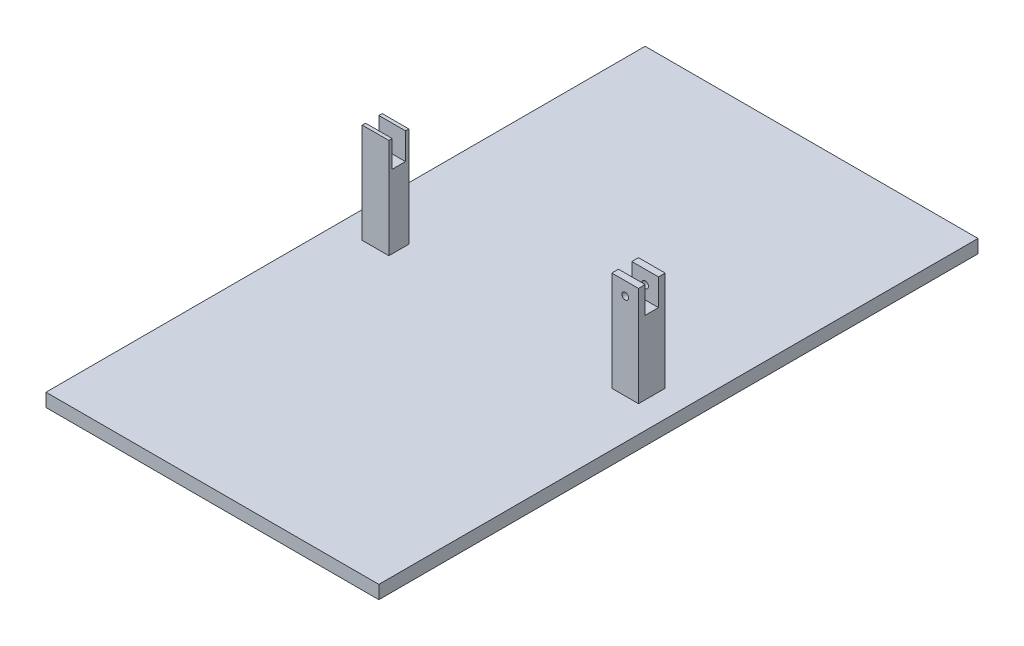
ISO-10303-21;
HEADER;
FILE_DESCRIPTION(('STEP AP214'),'2;1');
FILE_NAME('part.step','',(''),(''),'','','');
FILE_SCHEMA(('AUTOMOTIVE_DESIGN { 1 0 10303 214 1 1 1 1 }'));
ENDSEC;
DATA;
#1=APPLICATION_CONTEXT('core data for automotive mechanical design processes');
#2=APPLICATION_PROTOCOL_DEFINITION('international standard','automotive_design',2000,#1);
#3=PRODUCT_CONTEXT('',#1,'mechanical');
#4=PRODUCT('Part','Part','',(#3));
#5=PRODUCT_RELATED_PRODUCT_CATEGORY('part','',(#4));
#6=PRODUCT_DEFINITION_FORMATION('','',#4);
#7=PRODUCT_DEFINITION_CONTEXT('part definition',#1,'design');
#8=PRODUCT_DEFINITION('design','',#6,#7);
#9=PRODUCT_DEFINITION_SHAPE('','',#8);
#10=(LENGTH_UNIT() NAMED_UNIT(*) SI_UNIT(.MILLI.,.METRE.));
#11=(NAMED_UNIT(*) PLANE_ANGLE_UNIT() SI_UNIT($,.RADIAN.));
#12=(NAMED_UNIT(*) SI_UNIT($,.STERADIAN.) SOLID_ANGLE_UNIT());
#13=UNCERTAINTY_MEASURE_WITH_UNIT(LENGTH_MEASURE(1.E-05),#10,'distance_accuracy_value','');
#14=(GEOMETRIC_REPRESENTATION_CONTEXT(3) GLOBAL_UNCERTAINTY_ASSIGNED_CONTEXT((#13)) GLOBAL_UNIT_ASSIGNED_CONTEXT((#10,
#11,#12)) REPRESENTATION_CONTEXT('',''));
#15=CARTESIAN_POINT('',(0.,0.,0.));
#16=DIRECTION('',(0.,0.,1.));
#17=DIRECTION('',(1.,0.,0.));
#18=AXIS2_PLACEMENT_3D('',#15,#16,#17);
#19=CARTESIAN_POINT('',(17.,17.,2.));
#20=DIRECTION('',(0.,1.,0.));
#21=DIRECTION('',(0.,0.,1.));
#22=AXIS2_PLACEMENT_3D('',#19,#20,#21);
#23=PLANE('',#22);
#24=DIRECTION('',(1.,0.,0.));
#25=VECTOR('',#24,1.);
#26=CARTESIAN_POINT('',(-25.,17.,1.));
#27=LINE('',#26,#25);
#28=CARTESIAN_POINT('',(17.,17.,1.));
#29=VERTEX_POINT('',#28);
#30=CARTESIAN_POINT('',(21.,17.,1.));
#31=VERTEX_POINT('',#30);
#32=EDGE_CURVE('E187',#29,#31,#27,.T.);
#33=ORIENTED_EDGE('',*,*,#32,.F.);
#34=DIRECTION('',(0.,0.,1.));
#35=VECTOR('',#34,1.);
#36=CARTESIAN_POINT('',(17.,17.,-2.));
#37=LINE('',#36,#35);
#38=CARTESIAN_POINT('',(17.,17.,2.));
#39=VERTEX_POINT('',#38);
#40=EDGE_CURVE('E261',#29,#39,#37,.T.);
#41=ORIENTED_EDGE('',*,*,#40,.T.);
#42=DIRECTION('',(1.,0.,0.));
#43=VECTOR('',#42,1.);
#44=CARTESIAN_POINT('',(17.,17.,2.));
#45=LINE('',#44,#43);
#46=CARTESIAN_POINT('',(21.,17.,2.));
#47=VERTEX_POINT('',#46);
#48=EDGE_CURVE('E260',#39,#47,#45,.T.);
#49=ORIENTED_EDGE('',*,*,#48,.T.);
#50=DIRECTION('',(0.,0.,-1.));
#51=VECTOR('',#50,1.);
#52=CARTESIAN_POINT('',(21.,17.,-2.));
#53=LINE('',#52,#51);
#54=EDGE_CURVE('E264',#47,#31,#53,.T.);
#55=ORIENTED_EDGE('',*,*,#54,.T.);
#56=EDGE_LOOP('',(#33,#41,#49,#55));
#57=FACE_BOUND('',#56,.T.);
#58=ADVANCED_FACE('F32',(#57),#23,.T.);
#59=CARTESIAN_POINT('',(-21.,17.,1.5));
#60=DIRECTION('',(0.,1.,0.));
#61=DIRECTION('',(0.,0.,1.));
#62=AXIS2_PLACEMENT_3D('',#59,#60,#61);
#63=PLANE('',#62);
#64=DIRECTION('',(1.,0.,0.));
#65=VECTOR('',#64,1.);
#66=CARTESIAN_POINT('',(-21.,17.,1.));
#67=LINE('',#66,#65);
#68=CARTESIAN_POINT('',(-21.,17.,1.));
#69=VERTEX_POINT('',#68);
#70=CARTESIAN_POINT('',(-17.,17.,1.));
#71=VERTEX_POINT('',#70);
#72=EDGE_CURVE('E41',#69,#71,#67,.T.);
#73=ORIENTED_EDGE('',*,*,#72,.F.);
#74=DIRECTION('',(0.,0.,1.));
#75=VECTOR('',#74,1.);
#76=CARTESIAN_POINT('',(-21.,17.,-1.5));
#77=LINE('',#76,#75);
#78=CARTESIAN_POINT('',(-21.,17.,1.5));
#79=VERTEX_POINT('',#78);
#80=EDGE_CURVE('E229',#69,#79,#77,.T.);
#81=ORIENTED_EDGE('',*,*,#80,.T.);
#82=DIRECTION('',(1.,0.,0.));
#83=VECTOR('',#82,1.);
#84=CARTESIAN_POINT('',(-21.,17.,1.5));
#85=LINE('',#84,#83);
#86=CARTESIAN_POINT('',(-17.,17.,1.5));
#87=VERTEX_POINT('',#86);
#88=EDGE_CURVE('E228',#79,#87,#85,.T.);
#89=ORIENTED_EDGE('',*,*,#88,.T.);
#90=DIRECTION('',(0.,0.,-1.));
#91=VECTOR('',#90,1.);
#92=CARTESIAN_POINT('',(-17.,17.,-1.5));
#93=LINE('',#92,#91);
#94=EDGE_CURVE('E232',#87,#71,#93,.T.);
#95=ORIENTED_EDGE('',*,*,#94,.T.);
#96=EDGE_LOOP('',(#73,#81,#89,#95));
#97=FACE_BOUND('',#96,.T.);
#98=ADVANCED_FACE('F329',(#97),#63,.T.);
#99=CARTESIAN_POINT('',(-25.,2.,45.));
#100=DIRECTION('',(0.,1.,0.));
#101=DIRECTION('',(0.,0.,1.));
#102=AXIS2_PLACEMENT_3D('',#99,#100,#101);
#103=PLANE('',#102);
#104=DIRECTION('',(1.,0.,0.));
#105=VECTOR('',#104,1.);
#106=CARTESIAN_POINT('',(17.,2.,2.));
#107=LINE('',#106,#105);
#108=CARTESIAN_POINT('',(17.,2.,2.));
#109=VERTEX_POINT('',#108);
#110=CARTESIAN_POINT('',(21.,2.,2.));
#111=VERTEX_POINT('',#110);
#112=EDGE_CURVE('E271',#109,#111,#107,.T.);
#113=ORIENTED_EDGE('',*,*,#112,.F.);
#114=DIRECTION('',(0.,0.,1.));
#115=VECTOR('',#114,1.);
#116=CARTESIAN_POINT('',(17.,2.,-2.));
#117=LINE('',#116,#115);
#118=CARTESIAN_POINT('',(17.,2.,-2.));
#119=VERTEX_POINT('',#118);
#120=EDGE_CURVE('E256',#119,#109,#117,.T.);
#121=ORIENTED_EDGE('',*,*,#120,.F.);
#122=DIRECTION('',(-1.,0.,0.));
#123=VECTOR('',#122,1.);
#124=CARTESIAN_POINT('',(17.,2.,-2.));
#125=LINE('',#124,#123);
#126=CARTESIAN_POINT('',(21.,2.,-2.));
#127=VERTEX_POINT('',#126);
#128=EDGE_CURVE('E276',#127,#119,#125,.T.);
#129=ORIENTED_EDGE('',*,*,#128,.F.);
#130=DIRECTION('',(0.,0.,-1.));
#131=VECTOR('',#130,1.);
#132=CARTESIAN_POINT('',(21.,2.,-2.));
#133=LINE('',#132,#131);
#134=EDGE_CURVE('E273',#111,#127,#133,.T.);
#135=ORIENTED_EDGE('',*,*,#134,.F.);
#136=EDGE_LOOP('',(#113,#121,#129,#135));
#137=FACE_BOUND('',#136,.T.);
#138=DIRECTION('',(0.,0.,1.));
#139=VECTOR('',#138,1.);
#140=CARTESIAN_POINT('',(-25.,2.,-45.));
#141=LINE('',#140,#139);
#142=CARTESIAN_POINT('',(-25.,2.,-45.));
#143=VERTEX_POINT('',#142);
#144=CARTESIAN_POINT('',(-25.,2.,45.));
#145=VERTEX_POINT('',#144);
#146=EDGE_CURVE('E288',#143,#145,#141,.T.);
#147=ORIENTED_EDGE('',*,*,#146,.T.);
#148=DIRECTION('',(1.,0.,0.));
#149=VECTOR('',#148,1.);
#150=CARTESIAN_POINT('',(-25.,2.,45.));
#151=LINE('',#150,#149);
#152=CARTESIAN_POINT('',(25.,2.,45.));
#153=VERTEX_POINT('',#152);
#154=EDGE_CURVE('E291',#145,#153,#151,.T.);
#155=ORIENTED_EDGE('',*,*,#154,.T.);
#156=DIRECTION('',(0.,0.,-1.));
#157=VECTOR('',#156,1.);
#158=CARTESIAN_POINT('',(25.,2.,-45.));
#159=LINE('',#158,#157);
#160=CARTESIAN_POINT('',(25.,2.,-45.));
#161=VERTEX_POINT('',#160);
#162=EDGE_CURVE('E294',#153,#161,#159,.T.);
#163=ORIENTED_EDGE('',*,*,#162,.T.);
#164=DIRECTION('',(-1.,0.,0.));
#165=VECTOR('',#164,1.);
#166=CARTESIAN_POINT('',(-25.,2.,-45.));
#167=LINE('',#166,#165);
#168=EDGE_CURVE('E296',#161,#143,#167,.T.);
#169=ORIENTED_EDGE('',*,*,#168,.T.);
#170=EDGE_LOOP('',(#147,#155,#163,#169));
#171=FACE_BOUND('',#170,.T.);
#172=DIRECTION('',(1.,0.,0.));
#173=VECTOR('',#172,1.);
#174=CARTESIAN_POINT('',(-21.,2.,1.5));
#175=LINE('',#174,#173);
#176=CARTESIAN_POINT('',(-21.,2.,1.5));
#177=VERTEX_POINT('',#176);
#178=CARTESIAN_POINT('',(-17.,2.,1.5));
#179=VERTEX_POINT('',#178);
#180=EDGE_CURVE('E240',#177,#179,#175,.T.);
#181=ORIENTED_EDGE('',*,*,#180,.F.);
#182=DIRECTION('',(0.,0.,1.));
#183=VECTOR('',#182,1.);
#184=CARTESIAN_POINT('',(-21.,2.,-1.5));
#185=LINE('',#184,#183);
#186=CARTESIAN_POINT('',(-21.,2.,-1.5));
#187=VERTEX_POINT('',#186);
#188=EDGE_CURVE('E224',#187,#177,#185,.T.);
#189=ORIENTED_EDGE('',*,*,#188,.F.);
#190=DIRECTION('',(-1.,0.,0.));
#191=VECTOR('',#190,1.);
#192=CARTESIAN_POINT('',(-21.,2.,-1.5));
#193=LINE('',#192,#191);
#194=CARTESIAN_POINT('',(-17.,2.,-1.5));
#195=VERTEX_POINT('',#194);
#196=EDGE_CURVE('E245',#195,#187,#193,.T.);
#197=ORIENTED_EDGE('',*,*,#196,.F.);
#198=DIRECTION('',(0.,0.,-1.));
#199=VECTOR('',#198,1.);
#200=CARTESIAN_POINT('',(-17.,2.,-1.5));
#201=LINE('',#200,#199);
#202=EDGE_CURVE('E242',#179,#195,#201,.T.);
#203=ORIENTED_EDGE('',*,*,#202,.F.);
#204=EDGE_LOOP('',(#181,#189,#197,#203));
#205=FACE_BOUND('',#204,.T.);
#206=ADVANCED_FACE('F340',(#137,#171,#205),#103,.T.);
#207=CARTESIAN_POINT('',(-25.,2.,-45.));
#208=DIRECTION('',(1.,0.,0.));
#209=DIRECTION('',(0.,0.,-1.));
#210=AXIS2_PLACEMENT_3D('',#207,#208,#209);
#211=PLANE('',#210);
#212=DIRECTION('',(0.,0.,1.));
#213=VECTOR('',#212,1.);
#214=CARTESIAN_POINT('',(-25.,0.,-45.));
#215=LINE('',#214,#213);
#216=CARTESIAN_POINT('',(-25.,0.,-45.));
#217=VERTEX_POINT('',#216);
#218=CARTESIAN_POINT('',(-25.,0.,45.));
#219=VERTEX_POINT('',#218);
#220=EDGE_CURVE('E287',#217,#219,#215,.T.);
#221=ORIENTED_EDGE('',*,*,#220,.T.);
#222=DIRECTION('',(0.,-1.,0.));
#223=VECTOR('',#222,1.);
#224=CARTESIAN_POINT('',(-25.,2.,45.));
#225=LINE('',#224,#223);
#226=EDGE_CURVE('E314',#145,#219,#225,.T.);
#227=ORIENTED_EDGE('',*,*,#226,.F.);
#228=ORIENTED_EDGE('',*,*,#146,.F.);
#229=DIRECTION('',(0.,-1.,0.));
#230=VECTOR('',#229,1.);
#231=CARTESIAN_POINT('',(-25.,2.,-45.));
#232=LINE('',#231,#230);
#233=EDGE_CURVE('E298',#143,#217,#232,.T.);
#234=ORIENTED_EDGE('',*,*,#233,.T.);
#235=EDGE_LOOP('',(#221,#227,#228,#234));
#236=FACE_BOUND('',#235,.T.);
#237=ADVANCED_FACE('F34',(#236),#211,.F.);
#238=CARTESIAN_POINT('',(-25.,2.,45.));
#239=DIRECTION('',(0.,0.,-1.));
#240=DIRECTION('',(-1.,0.,0.));
#241=AXIS2_PLACEMENT_3D('',#238,#239,#240);
#242=PLANE('',#241);
#243=DIRECTION('',(1.,0.,0.));
#244=VECTOR('',#243,1.);
#245=CARTESIAN_POINT('',(-25.,0.,45.));
#246=LINE('',#245,#244);
#247=CARTESIAN_POINT('',(25.,0.,45.));
#248=VERTEX_POINT('',#247);
#249=EDGE_CURVE('E301',#219,#248,#246,.T.);
#250=ORIENTED_EDGE('',*,*,#249,.T.);
#251=DIRECTION('',(0.,-1.,0.));
#252=VECTOR('',#251,1.);
#253=CARTESIAN_POINT('',(25.,2.,45.));
#254=LINE('',#253,#252);
#255=EDGE_CURVE('E311',#153,#248,#254,.T.);
#256=ORIENTED_EDGE('',*,*,#255,.F.);
#257=ORIENTED_EDGE('',*,*,#154,.F.);
#258=ORIENTED_EDGE('',*,*,#226,.T.);
#259=EDGE_LOOP('',(#250,#256,#257,#258));
#260=FACE_BOUND('',#259,.T.);
#261=ADVANCED_FACE('F547',(#260),#242,.F.);
#262=CARTESIAN_POINT('',(25.,2.,-45.));
#263=DIRECTION('',(-1.,0.,0.));
#264=DIRECTION('',(0.,0.,1.));
#265=AXIS2_PLACEMENT_3D('',#262,#263,#264);
#266=PLANE('',#265);
#267=DIRECTION('',(0.,0.,-1.));
#268=VECTOR('',#267,1.);
#269=CARTESIAN_POINT('',(25.,0.,-45.));
#270=LINE('',#269,#268);
#271=CARTESIAN_POINT('',(25.,0.,-45.));
#272=VERTEX_POINT('',#271);
#273=EDGE_CURVE('E303',#248,#272,#270,.T.);
#274=ORIENTED_EDGE('',*,*,#273,.T.);
#275=DIRECTION('',(0.,-1.,0.));
#276=VECTOR('',#275,1.);
#277=CARTESIAN_POINT('',(25.,2.,-45.));
#278=LINE('',#277,#276);
#279=EDGE_CURVE('E308',#161,#272,#278,.T.);
#280=ORIENTED_EDGE('',*,*,#279,.F.);
#281=ORIENTED_EDGE('',*,*,#162,.F.);
#282=ORIENTED_EDGE('',*,*,#255,.T.);
#283=EDGE_LOOP('',(#274,#280,#281,#282));
#284=FACE_BOUND('',#283,.T.);
#285=ADVANCED_FACE('F552',(#284),#266,.F.);
#286=CARTESIAN_POINT('',(-25.,2.,-45.));
#287=DIRECTION('',(0.,0.,1.));
#288=DIRECTION('',(1.,0.,0.));
#289=AXIS2_PLACEMENT_3D('',#286,#287,#288);
#290=PLANE('',#289);
#291=DIRECTION('',(-1.,0.,0.));
#292=VECTOR('',#291,1.);
#293=CARTESIAN_POINT('',(-25.,0.,-45.));
#294=LINE('',#293,#292);
#295=EDGE_CURVE('E292',#272,#217,#294,.T.);
#296=ORIENTED_EDGE('',*,*,#295,.T.);
#297=ORIENTED_EDGE('',*,*,#233,.F.);
#298=ORIENTED_EDGE('',*,*,#168,.F.);
#299=ORIENTED_EDGE('',*,*,#279,.T.);
#300=EDGE_LOOP('',(#296,#297,#298,#299));
#301=FACE_BOUND('',#300,.T.);
#302=ADVANCED_FACE('F555',(#301),#290,.F.);
#303=CARTESIAN_POINT('',(-25.,0.,45.));
#304=DIRECTION('',(0.,1.,0.));
#305=DIRECTION('',(0.,0.,1.));
#306=AXIS2_PLACEMENT_3D('',#303,#304,#305);
#307=PLANE('',#306);
#308=ORIENTED_EDGE('',*,*,#220,.F.);
#309=ORIENTED_EDGE('',*,*,#295,.F.);
#310=ORIENTED_EDGE('',*,*,#273,.F.);
#311=ORIENTED_EDGE('',*,*,#249,.F.);
#312=EDGE_LOOP('',(#308,#309,#310,#311));
#313=FACE_BOUND('',#312,.T.);
#314=ADVANCED_FACE('F454',(#313),#307,.F.);
#315=CARTESIAN_POINT('',(17.,17.,-2.));
#316=DIRECTION('',(1.,0.,0.));
#317=DIRECTION('',(0.,0.,-1.));
#318=AXIS2_PLACEMENT_3D('',#315,#316,#317);
#319=PLANE('',#318);
#320=ORIENTED_EDGE('',*,*,#40,.F.);
#321=DIRECTION('',(0.,-1.,0.));
#322=VECTOR('',#321,1.);
#323=CARTESIAN_POINT('',(17.,17.,1.));
#324=LINE('',#323,#322);
#325=CARTESIAN_POINT('',(17.,13.,1.));
#326=VERTEX_POINT('',#325);
#327=EDGE_CURVE('E218',#29,#326,#324,.T.);
#328=ORIENTED_EDGE('',*,*,#327,.T.);
#329=DIRECTION('',(0.,0.,-1.));
#330=VECTOR('',#329,1.);
#331=CARTESIAN_POINT('',(17.,13.,-2.));
#332=LINE('',#331,#330);
#333=CARTESIAN_POINT('',(17.,13.,-1.));
#334=VERTEX_POINT('',#333);
#335=EDGE_CURVE('E178',#326,#334,#332,.T.);
#336=ORIENTED_EDGE('',*,*,#335,.T.);
#337=DIRECTION('',(0.,1.,0.));
#338=VECTOR('',#337,1.);
#339=CARTESIAN_POINT('',(17.,17.,-1.));
#340=LINE('',#339,#338);
#341=CARTESIAN_POINT('',(17.,17.,-1.));
#342=VERTEX_POINT('',#341);
#343=EDGE_CURVE('E209',#334,#342,#340,.T.);
#344=ORIENTED_EDGE('',*,*,#343,.T.);
#345=CARTESIAN_POINT('',(17.,17.,-2.));
#346=VERTEX_POINT('',#345);
#347=EDGE_CURVE('E257',#346,#342,#37,.T.);
#348=ORIENTED_EDGE('',*,*,#347,.F.);
#349=DIRECTION('',(0.,-1.,0.));
#350=VECTOR('',#349,1.);
#351=CARTESIAN_POINT('',(17.,17.,-2.));
#352=LINE('',#351,#350);
#353=EDGE_CURVE('E268',#346,#119,#352,.T.);
#354=ORIENTED_EDGE('',*,*,#353,.T.);
#355=ORIENTED_EDGE('',*,*,#120,.T.);
#356=DIRECTION('',(0.,-1.,0.));
#357=VECTOR('',#356,1.);
#358=CARTESIAN_POINT('',(17.,17.,2.));
#359=LINE('',#358,#357);
#360=EDGE_CURVE('E285',#39,#109,#359,.T.);
#361=ORIENTED_EDGE('',*,*,#360,.F.);
#362=EDGE_LOOP('',(#320,#328,#336,#344,#348,#354,#355,#361));
#363=FACE_BOUND('',#362,.T.);
#364=ADVANCED_FACE('F392',(#363),#319,.F.);
#365=CARTESIAN_POINT('',(17.,17.,2.));
#366=DIRECTION('',(0.,0.,-1.));
#367=DIRECTION('',(-1.,0.,0.));
#368=AXIS2_PLACEMENT_3D('',#365,#366,#367);
#369=PLANE('',#368);
#370=CARTESIAN_POINT('',(19.,15.,2.));
#371=DIRECTION('',(0.,0.,1.));
#372=DIRECTION('',(1.,0.,0.));
#373=AXIS2_PLACEMENT_3D('',#370,#371,#372);
#374=CIRCLE('',#373,0.499999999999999);
#375=CARTESIAN_POINT('',(19.5,15.,2.));
#376=VERTEX_POINT('',#375);
#377=EDGE_CURVE('E519',#376,#376,#374,.T.);
#378=ORIENTED_EDGE('',*,*,#377,.F.);
#379=EDGE_LOOP('',(#378));
#380=FACE_BOUND('',#379,.T.);
#381=ORIENTED_EDGE('',*,*,#112,.T.);
#382=DIRECTION('',(0.,-1.,0.));
#383=VECTOR('',#382,1.);
#384=CARTESIAN_POINT('',(21.,17.,2.));
#385=LINE('',#384,#383);
#386=EDGE_CURVE('E282',#47,#111,#385,.T.);
#387=ORIENTED_EDGE('',*,*,#386,.F.);
#388=ORIENTED_EDGE('',*,*,#48,.F.);
#389=ORIENTED_EDGE('',*,*,#360,.T.);
#390=EDGE_LOOP('',(#381,#387,#388,#389));
#391=FACE_BOUND('',#390,.T.);
#392=ADVANCED_FACE('F453',(#380,#391),#369,.F.);
#393=CARTESIAN_POINT('',(21.,17.,-2.));
#394=DIRECTION('',(-1.,0.,0.));
#395=DIRECTION('',(0.,0.,1.));
#396=AXIS2_PLACEMENT_3D('',#393,#394,#395);
#397=PLANE('',#396);
#398=DIRECTION('',(0.,0.,-1.));
#399=VECTOR('',#398,1.);
#400=CARTESIAN_POINT('',(21.,13.,1.));
#401=LINE('',#400,#399);
#402=CARTESIAN_POINT('',(21.,13.,1.));
#403=VERTEX_POINT('',#402);
#404=CARTESIAN_POINT('',(21.,13.,-1.));
#405=VERTEX_POINT('',#404);
#406=EDGE_CURVE('E176',#403,#405,#401,.T.);
#407=ORIENTED_EDGE('',*,*,#406,.F.);
#408=DIRECTION('',(0.,-1.,0.));
#409=VECTOR('',#408,1.);
#410=CARTESIAN_POINT('',(21.,17.,1.));
#411=LINE('',#410,#409);
#412=EDGE_CURVE('E184',#31,#403,#411,.T.);
#413=ORIENTED_EDGE('',*,*,#412,.F.);
#414=ORIENTED_EDGE('',*,*,#54,.F.);
#415=ORIENTED_EDGE('',*,*,#386,.T.);
#416=ORIENTED_EDGE('',*,*,#134,.T.);
#417=DIRECTION('',(0.,-1.,0.));
#418=VECTOR('',#417,1.);
#419=CARTESIAN_POINT('',(21.,17.,-2.));
#420=LINE('',#419,#418);
#421=CARTESIAN_POINT('',(21.,17.,-2.));
#422=VERTEX_POINT('',#421);
#423=EDGE_CURVE('E280',#422,#127,#420,.T.);
#424=ORIENTED_EDGE('',*,*,#423,.F.);
#425=CARTESIAN_POINT('',(21.,17.,-1.));
#426=VERTEX_POINT('',#425);
#427=EDGE_CURVE('E263',#426,#422,#53,.T.);
#428=ORIENTED_EDGE('',*,*,#427,.F.);
#429=DIRECTION('',(0.,1.,0.));
#430=VECTOR('',#429,1.);
#431=CARTESIAN_POINT('',(21.,17.,-1.));
#432=LINE('',#431,#430);
#433=EDGE_CURVE('E48',#405,#426,#432,.T.);
#434=ORIENTED_EDGE('',*,*,#433,.F.);
#435=EDGE_LOOP('',(#407,#413,#414,#415,#416,#424,#428,#434));
#436=FACE_BOUND('',#435,.T.);
#437=ADVANCED_FACE('F193',(#436),#397,.F.);
#438=CARTESIAN_POINT('',(17.,17.,-2.));
#439=DIRECTION('',(0.,0.,1.));
#440=DIRECTION('',(1.,0.,0.));
#441=AXIS2_PLACEMENT_3D('',#438,#439,#440);
#442=PLANE('',#441);
#443=CARTESIAN_POINT('',(19.,15.,-2.));
#444=DIRECTION('',(0.,0.,1.));
#445=DIRECTION('',(1.,0.,0.));
#446=AXIS2_PLACEMENT_3D('',#443,#444,#445);
#447=CIRCLE('',#446,0.499999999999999);
#448=CARTESIAN_POINT('',(19.5,15.,-2.));
#449=VERTEX_POINT('',#448);
#450=EDGE_CURVE('E191',#449,#449,#447,.T.);
#451=ORIENTED_EDGE('',*,*,#450,.T.);
#452=EDGE_LOOP('',(#451));
#453=FACE_BOUND('',#452,.T.);
#454=ORIENTED_EDGE('',*,*,#128,.T.);
#455=ORIENTED_EDGE('',*,*,#353,.F.);
#456=DIRECTION('',(-1.,0.,0.));
#457=VECTOR('',#456,1.);
#458=CARTESIAN_POINT('',(17.,17.,-2.));
#459=LINE('',#458,#457);
#460=EDGE_CURVE('E266',#422,#346,#459,.T.);
#461=ORIENTED_EDGE('',*,*,#460,.F.);
#462=ORIENTED_EDGE('',*,*,#423,.T.);
#463=EDGE_LOOP('',(#454,#455,#461,#462));
#464=FACE_BOUND('',#463,.T.);
#465=ADVANCED_FACE('F375',(#453,#464),#442,.F.);
#466=DIRECTION('',(1.,0.,0.));
#467=VECTOR('',#466,1.);
#468=CARTESIAN_POINT('',(-25.,17.,-1.));
#469=LINE('',#468,#467);
#470=EDGE_CURVE('E200',#342,#426,#469,.T.);
#471=ORIENTED_EDGE('',*,*,#470,.T.);
#472=ORIENTED_EDGE('',*,*,#427,.T.);
#473=ORIENTED_EDGE('',*,*,#460,.T.);
#474=ORIENTED_EDGE('',*,*,#347,.T.);
#475=EDGE_LOOP('',(#471,#472,#473,#474));
#476=FACE_BOUND('',#475,.T.);
#477=ADVANCED_FACE('F367',(#476),#23,.T.);
#478=CARTESIAN_POINT('',(-21.,17.,-1.5));
#479=DIRECTION('',(1.,0.,0.));
#480=DIRECTION('',(0.,0.,-1.));
#481=AXIS2_PLACEMENT_3D('',#478,#479,#480);
#482=PLANE('',#481);
#483=ORIENTED_EDGE('',*,*,#80,.F.);
#484=DIRECTION('',(0.,-1.,0.));
#485=VECTOR('',#484,1.);
#486=CARTESIAN_POINT('',(-21.,17.,1.));
#487=LINE('',#486,#485);
#488=CARTESIAN_POINT('',(-21.,13.,1.));
#489=VERTEX_POINT('',#488);
#490=EDGE_CURVE('E215',#69,#489,#487,.T.);
#491=ORIENTED_EDGE('',*,*,#490,.T.);
#492=DIRECTION('',(0.,0.,-1.));
#493=VECTOR('',#492,1.);
#494=CARTESIAN_POINT('',(-21.,13.,-1.5));
#495=LINE('',#494,#493);
#496=CARTESIAN_POINT('',(-21.,13.,-1.));
#497=VERTEX_POINT('',#496);
#498=EDGE_CURVE('E220',#489,#497,#495,.T.);
#499=ORIENTED_EDGE('',*,*,#498,.T.);
#500=DIRECTION('',(0.,1.,0.));
#501=VECTOR('',#500,1.);
#502=CARTESIAN_POINT('',(-21.,17.,-1.));
#503=LINE('',#502,#501);
#504=CARTESIAN_POINT('',(-21.,17.,-1.));
#505=VERTEX_POINT('',#504);
#506=EDGE_CURVE('E206',#497,#505,#503,.T.);
#507=ORIENTED_EDGE('',*,*,#506,.T.);
#508=CARTESIAN_POINT('',(-21.,17.,-1.5));
#509=VERTEX_POINT('',#508);
#510=EDGE_CURVE('E225',#509,#505,#77,.T.);
#511=ORIENTED_EDGE('',*,*,#510,.F.);
#512=DIRECTION('',(0.,-1.,0.));
#513=VECTOR('',#512,1.);
#514=CARTESIAN_POINT('',(-21.,17.,-1.5));
#515=LINE('',#514,#513);
#516=EDGE_CURVE('E237',#509,#187,#515,.T.);
#517=ORIENTED_EDGE('',*,*,#516,.T.);
#518=ORIENTED_EDGE('',*,*,#188,.T.);
#519=DIRECTION('',(0.,-1.,0.));
#520=VECTOR('',#519,1.);
#521=CARTESIAN_POINT('',(-21.,17.,1.5));
#522=LINE('',#521,#520);
#523=EDGE_CURVE('E254',#79,#177,#522,.T.);
#524=ORIENTED_EDGE('',*,*,#523,.F.);
#525=EDGE_LOOP('',(#483,#491,#499,#507,#511,#517,#518,#524));
#526=FACE_BOUND('',#525,.T.);
#527=ADVANCED_FACE('F348',(#526),#482,.F.);
#528=CARTESIAN_POINT('',(-21.,17.,1.5));
#529=DIRECTION('',(0.,0.,-1.));
#530=DIRECTION('',(-1.,0.,0.));
#531=AXIS2_PLACEMENT_3D('',#528,#529,#530);
#532=PLANE('',#531);
#533=ORIENTED_EDGE('',*,*,#180,.T.);
#534=DIRECTION('',(0.,-1.,0.));
#535=VECTOR('',#534,1.);
#536=CARTESIAN_POINT('',(-17.,17.,1.5));
#537=LINE('',#536,#535);
#538=EDGE_CURVE('E251',#87,#179,#537,.T.);
#539=ORIENTED_EDGE('',*,*,#538,.F.);
#540=ORIENTED_EDGE('',*,*,#88,.F.);
#541=ORIENTED_EDGE('',*,*,#523,.T.);
#542=EDGE_LOOP('',(#533,#539,#540,#541));
#543=FACE_BOUND('',#542,.T.);
#544=ADVANCED_FACE('F334',(#543),#532,.F.);
#545=CARTESIAN_POINT('',(-17.,17.,-1.5));
#546=DIRECTION('',(-1.,0.,0.));
#547=DIRECTION('',(0.,0.,1.));
#548=AXIS2_PLACEMENT_3D('',#545,#546,#547);
#549=PLANE('',#548);
#550=DIRECTION('',(0.,0.,1.));
#551=VECTOR('',#550,1.);
#552=CARTESIAN_POINT('',(-17.,13.,-1.5));
#553=LINE('',#552,#551);
#554=CARTESIAN_POINT('',(-17.,13.,-1.));
#555=VERTEX_POINT('',#554);
#556=CARTESIAN_POINT('',(-17.,13.,1.));
#557=VERTEX_POINT('',#556);
#558=EDGE_CURVE('E11',#555,#557,#553,.T.);
#559=ORIENTED_EDGE('',*,*,#558,.T.);
#560=DIRECTION('',(0.,1.,0.));
#561=VECTOR('',#560,1.);
#562=CARTESIAN_POINT('',(-17.,17.,1.));
#563=LINE('',#562,#561);
#564=EDGE_CURVE('E212',#557,#71,#563,.T.);
#565=ORIENTED_EDGE('',*,*,#564,.T.);
#566=ORIENTED_EDGE('',*,*,#94,.F.);
#567=ORIENTED_EDGE('',*,*,#538,.T.);
#568=ORIENTED_EDGE('',*,*,#202,.T.);
#569=DIRECTION('',(0.,-1.,0.));
#570=VECTOR('',#569,1.);
#571=CARTESIAN_POINT('',(-17.,17.,-1.5));
#572=LINE('',#571,#570);
#573=CARTESIAN_POINT('',(-17.,17.,-1.5));
#574=VERTEX_POINT('',#573);
#575=EDGE_CURVE('E249',#574,#195,#572,.T.);
#576=ORIENTED_EDGE('',*,*,#575,.F.);
#577=CARTESIAN_POINT('',(-17.,17.,-1.));
#578=VERTEX_POINT('',#577);
#579=EDGE_CURVE('E231',#578,#574,#93,.T.);
#580=ORIENTED_EDGE('',*,*,#579,.F.);
#581=DIRECTION('',(0.,-1.,0.));
#582=VECTOR('',#581,1.);
#583=CARTESIAN_POINT('',(-17.,17.,-1.));
#584=LINE('',#583,#582);
#585=EDGE_CURVE('E56',#578,#555,#584,.T.);
#586=ORIENTED_EDGE('',*,*,#585,.T.);
#587=EDGE_LOOP('',(#559,#565,#566,#567,#568,#576,#580,#586));
#588=FACE_BOUND('',#587,.T.);
#589=ADVANCED_FACE('F328',(#588),#549,.F.);
#590=CARTESIAN_POINT('',(-21.,17.,-1.5));
#591=DIRECTION('',(0.,0.,1.));
#592=DIRECTION('',(1.,0.,0.));
#593=AXIS2_PLACEMENT_3D('',#590,#591,#592);
#594=PLANE('',#593);
#595=ORIENTED_EDGE('',*,*,#196,.T.);
#596=ORIENTED_EDGE('',*,*,#516,.F.);
#597=DIRECTION('',(-1.,0.,0.));
#598=VECTOR('',#597,1.);
#599=CARTESIAN_POINT('',(-21.,17.,-1.5));
#600=LINE('',#599,#598);
#601=EDGE_CURVE('E235',#574,#509,#600,.T.);
#602=ORIENTED_EDGE('',*,*,#601,.F.);
#603=ORIENTED_EDGE('',*,*,#575,.T.);
#604=EDGE_LOOP('',(#595,#596,#602,#603));
#605=FACE_BOUND('',#604,.T.);
#606=ADVANCED_FACE('F344',(#605),#594,.F.);
#607=DIRECTION('',(-1.,0.,0.));
#608=VECTOR('',#607,1.);
#609=CARTESIAN_POINT('',(-21.,17.,-1.));
#610=LINE('',#609,#608);
#611=EDGE_CURVE('E317',#578,#505,#610,.T.);
#612=ORIENTED_EDGE('',*,*,#611,.F.);
#613=ORIENTED_EDGE('',*,*,#579,.T.);
#614=ORIENTED_EDGE('',*,*,#601,.T.);
#615=ORIENTED_EDGE('',*,*,#510,.T.);
#616=EDGE_LOOP('',(#612,#613,#614,#615));
#617=FACE_BOUND('',#616,.T.);
#618=ADVANCED_FACE('F350',(#617),#63,.T.);
#619=CARTESIAN_POINT('',(-25.,17.,-1.));
#620=DIRECTION('',(0.,0.,-1.));
#621=DIRECTION('',(0.,1.,0.));
#622=AXIS2_PLACEMENT_3D('',#619,#620,#621);
#623=PLANE('',#622);
#624=DIRECTION('',(1.,0.,0.));
#625=VECTOR('',#624,1.);
#626=CARTESIAN_POINT('',(-25.,13.,-1.));
#627=LINE('',#626,#625);
#628=EDGE_CURVE('E202',#497,#555,#627,.T.);
#629=ORIENTED_EDGE('',*,*,#628,.T.);
#630=ORIENTED_EDGE('',*,*,#585,.F.);
#631=ORIENTED_EDGE('',*,*,#611,.T.);
#632=ORIENTED_EDGE('',*,*,#506,.F.);
#633=EDGE_LOOP('',(#629,#630,#631,#632));
#634=FACE_BOUND('',#633,.T.);
#635=ADVANCED_FACE('F352',(#634),#623,.F.);
#636=CARTESIAN_POINT('',(-25.,17.,1.));
#637=DIRECTION('',(0.,0.,1.));
#638=DIRECTION('',(0.,-1.,0.));
#639=AXIS2_PLACEMENT_3D('',#636,#637,#638);
#640=PLANE('',#639);
#641=ORIENTED_EDGE('',*,*,#72,.T.);
#642=ORIENTED_EDGE('',*,*,#564,.F.);
#643=DIRECTION('',(1.,0.,0.));
#644=VECTOR('',#643,1.);
#645=CARTESIAN_POINT('',(-25.,13.,1.));
#646=LINE('',#645,#644);
#647=EDGE_CURVE('E181',#489,#557,#646,.T.);
#648=ORIENTED_EDGE('',*,*,#647,.F.);
#649=ORIENTED_EDGE('',*,*,#490,.F.);
#650=EDGE_LOOP('',(#641,#642,#648,#649));
#651=FACE_BOUND('',#650,.T.);
#652=ADVANCED_FACE('F321',(#651),#640,.F.);
#653=CARTESIAN_POINT('',(-25.,13.,1.));
#654=DIRECTION('',(0.,-1.,0.));
#655=DIRECTION('',(0.,0.,-1.));
#656=AXIS2_PLACEMENT_3D('',#653,#654,#655);
#657=PLANE('',#656);
#658=ORIENTED_EDGE('',*,*,#647,.T.);
#659=ORIENTED_EDGE('',*,*,#558,.F.);
#660=ORIENTED_EDGE('',*,*,#628,.F.);
#661=ORIENTED_EDGE('',*,*,#498,.F.);
#662=EDGE_LOOP('',(#658,#659,#660,#661));
#663=FACE_BOUND('',#662,.T.);
#664=ADVANCED_FACE('F355',(#663),#657,.F.);
#665=EDGE_CURVE('E171',#326,#403,#646,.T.);
#666=ORIENTED_EDGE('',*,*,#665,.T.);
#667=ORIENTED_EDGE('',*,*,#406,.T.);
#668=EDGE_CURVE('E203',#334,#405,#627,.T.);
#669=ORIENTED_EDGE('',*,*,#668,.F.);
#670=ORIENTED_EDGE('',*,*,#335,.F.);
#671=EDGE_LOOP('',(#666,#667,#669,#670));
#672=FACE_BOUND('',#671,.T.);
#673=ADVANCED_FACE('F173',(#672),#657,.F.);
#674=CARTESIAN_POINT('',(19.,15.,1.));
#675=DIRECTION('',(0.,0.,1.));
#676=DIRECTION('',(0.,-1.,0.));
#677=AXIS2_PLACEMENT_3D('',#674,#675,#676);
#678=CIRCLE('',#677,0.499999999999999);
#679=CARTESIAN_POINT('',(19.,14.5,1.));
#680=VERTEX_POINT('',#679);
#681=EDGE_CURVE('E522',#680,#680,#678,.T.);
#682=ORIENTED_EDGE('',*,*,#681,.T.);
#683=EDGE_LOOP('',(#682));
#684=FACE_BOUND('',#683,.T.);
#685=ORIENTED_EDGE('',*,*,#32,.T.);
#686=ORIENTED_EDGE('',*,*,#412,.T.);
#687=ORIENTED_EDGE('',*,*,#665,.F.);
#688=ORIENTED_EDGE('',*,*,#327,.F.);
#689=EDGE_LOOP('',(#685,#686,#687,#688));
#690=FACE_BOUND('',#689,.T.);
#691=ADVANCED_FACE('F185',(#684,#690),#640,.F.);
#692=CARTESIAN_POINT('',(19.,15.,-1.));
#693=DIRECTION('',(0.,0.,-1.));
#694=DIRECTION('',(0.,1.,0.));
#695=AXIS2_PLACEMENT_3D('',#692,#693,#694);
#696=CIRCLE('',#695,0.499999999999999);
#697=CARTESIAN_POINT('',(19.,15.5,-1.));
#698=VERTEX_POINT('',#697);
#699=EDGE_CURVE('E36',#698,#698,#696,.T.);
#700=ORIENTED_EDGE('',*,*,#699,.T.);
#701=EDGE_LOOP('',(#700));
#702=FACE_BOUND('',#701,.T.);
#703=ORIENTED_EDGE('',*,*,#668,.T.);
#704=ORIENTED_EDGE('',*,*,#433,.T.);
#705=ORIENTED_EDGE('',*,*,#470,.F.);
#706=ORIENTED_EDGE('',*,*,#343,.F.);
#707=EDGE_LOOP('',(#703,#704,#705,#706));
#708=FACE_BOUND('',#707,.T.);
#709=ADVANCED_FACE('F393',(#702,#708),#623,.F.);
#710=CARTESIAN_POINT('',(19.,15.,-45.));
#711=DIRECTION('',(0.,0.,1.));
#712=DIRECTION('',(1.,0.,0.));
#713=AXIS2_PLACEMENT_3D('',#710,#711,#712);
#714=CYLINDRICAL_SURFACE('',#713,0.499999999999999);
#715=ORIENTED_EDGE('',*,*,#699,.F.);
#716=EDGE_LOOP('',(#715));
#717=FACE_BOUND('',#716,.T.);
#718=ORIENTED_EDGE('',*,*,#450,.F.);
#719=EDGE_LOOP('',(#718));
#720=FACE_BOUND('',#719,.T.);
#721=ADVANCED_FACE('F395',(#717,#720),#714,.F.);
#722=ORIENTED_EDGE('',*,*,#377,.T.);
#723=EDGE_LOOP('',(#722));
#724=FACE_BOUND('',#723,.T.);
#725=ORIENTED_EDGE('',*,*,#681,.F.);
#726=EDGE_LOOP('',(#725));
#727=FACE_BOUND('',#726,.T.);
#728=ADVANCED_FACE('F401',(#724,#727),#714,.F.);
#729=CLOSED_SHELL('',(#58,#98,#206,#237,#261,#285,#302,#314,#364,#392,#437,#465,#477,#527,#544,
#589,#606,#618,#635,#652,#664,#673,#691,#709,#721,#728));
#730=MANIFOLD_SOLID_BREP('B2',#729);
#731=ADVANCED_BREP_SHAPE_REPRESENTATION('',(#18,#730),#14);
#732=SHAPE_DEFINITION_REPRESENTATION(#9,#731);
ENDSEC;
END-ISO-10303-21;
